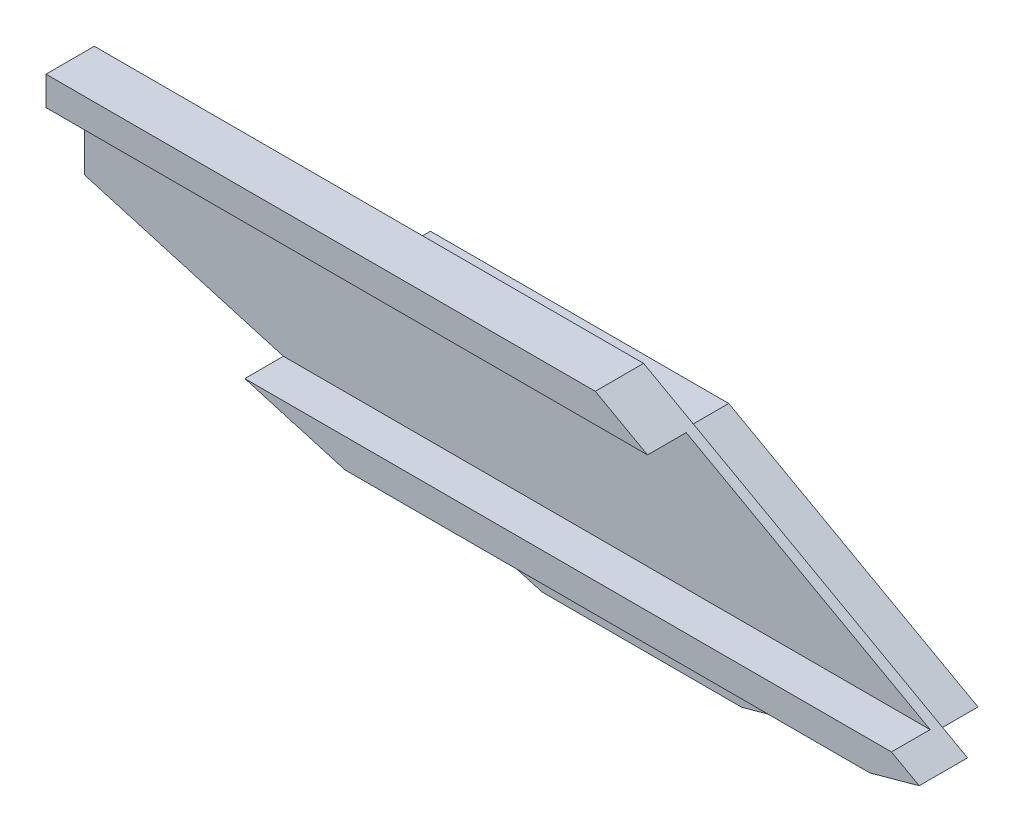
from build123d import *

# Parameters (mm, degrees)
SKETCH_1_W          = 33
SKETCH_1_H          = 10
EXTRUDE_1_DEPTH     = 0.5
SKETCH_2_W          = 34
SKETCH_2_H          = 11
SKETCH_2_W_2        = 33
SKETCH_2_H_2        = 10
EXTRUDE_2_DEPTH     = 1
SKETCH_3_W          = 34
SKETCH_3_H          = 11
EXTRUDE_3_DEPTH     = 0.5
EXTRUDE_4_DEPTH     = 1.275402
EXTRUDE_5_DEPTH     = 0.705896
EXTRUDE_6_DEPTH     = 0.5
EXTRUDE_7_DEPTH     = 1
CUT_EXTRUDE_2_DEPTH = 47.040166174
CUT_EXTRUDE_3_DEPTH = 1
CUT_EXTRUDE_4_DEPTH = 46.951093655
CUT_EXTRUDE_5_DEPTH = 1
CUT_EXTRUDE_7_DEPTH = 1
EXTRUDE_8_DEPTH     = 2
EXTRUDE_9_DEPTH     = 0.5
CUT_EXTRUDE_START   = -1.981298
CUT_EXTRUDE_8_DEPTH = 1.981298
CUT_EXTRUDE_9_DEPTH = 46.975366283


with BuildPart() as part:
    # Sketch 1 → Extrude 1 (new body)
    with BuildSketch(Plane.XY):
        with Locations((16.5, -5)):
            Rectangle(SKETCH_1_W, SKETCH_1_H)
    extrude(amount=EXTRUDE_1_DEPTH)



with BuildPart() as body_2:
    # Sketch 2 → Extrude 2 (new body)
    with BuildSketch(Plane.XY.offset(0.5)):
        with Locations((16.5, -5)):
            Rectangle(SKETCH_2_W, SKETCH_2_H)
        with Locations((16.5, -5)):
            Rectangle(SKETCH_2_W_2, SKETCH_2_H_2, mode=Mode.SUBTRACT)
    extrude(amount=EXTRUDE_2_DEPTH)


with BuildPart() as part_1:
    add(part.part)

    add(body_2.part)  # Extrude 3 merges body 2
    # Sketch 3 → Extrude 3 (add)
    with BuildSketch(Plane(origin=(0, 0, 0.5), x_dir=(-1, 0, 0), z_dir=(0, 0, -1))):
        with Locations((-16.5, -5)):
            Rectangle(SKETCH_3_W, SKETCH_3_H)
    extrude(amount=EXTRUDE_3_DEPTH)

    # Sketch 5 → Extrude 4 (add)
    with BuildSketch(Plane(origin=(0, 0, 0), x_dir=(-1, 0, 0), z_dir=(0, 0, -1))):
        Polygon((-13.305233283, 0.5), (-30.403614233, 0.5), (-33.5, -1.217019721), (-33.5, -4.597847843), align=None)
        Polygon((-33.5, -4.597847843), (-33.5, -1.217019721), (-44.691469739, -7.42295648), align=None)
        Polygon((-29.32623542, -8.976310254), (-33.5, -10.185064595), (-33.5, -10.368560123), (-29.016331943, -10.368560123), (-24.208967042, -8.976310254), align=None)
        Polygon((-19.411033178, -7.586791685), (-24.528301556, -7.586791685), (-19.720936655, -6.194541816), (-14.603668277, -6.194541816), align=None)
        Polygon((-14.923002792, -4.805023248), (-10.115637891, -3.412773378), (-4.998369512, -3.412773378), (-9.805734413, -4.805023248), align=None)
    extrude(amount=EXTRUDE_4_DEPTH)

    # Sketch 6 → Extrude 5 (add)
    with BuildSketch(Plane(origin=(0, 0, -1.275401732), x_dir=(-1, 0, 0), z_dir=(0, 0, -1))):
        Polygon((-44.691469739, -7.42295648), (-13.305233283, 0.5), (-30.403614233, 0.5), align=None)
    extrude(amount=EXTRUDE_5_DEPTH)

    # Sketch 7 → Extrude 6 (add)
    with BuildSketch(Plane.XY):
        Polygon((33.5, -1.217019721), (44.691469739, -7.42295648), (33.5, -10.5), align=None)
    extrude(amount=EXTRUDE_6_DEPTH)

    # Sketch 8 → Extrude 7 (add)
    with BuildSketch(Plane.XY.offset(0.5)):
        Polygon((34, -9.843972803), (43.377034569, -7.265799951), (34, -2.066010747), (33.5, -1.77877644), (30.403614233, 0), (30.403614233, 0.5), (33.5, -1.217019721), (44.691469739, -7.42295648), (33.5, -10.5), (33, -10.5), (33, -10), (33.5, -10), align=None)
    extrude(amount=EXTRUDE_7_DEPTH)

    # Sketch 9 → Cut-Extrude 2 (cut, through all)
    with BuildSketch(Plane.XY.offset(1.5)):
        Polygon((33, 0), (33, -0.939757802), (33.5, -1.217019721), (33.5, 0.5), (30.403614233, 0.5), (31.305288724, 0), align=None)
        Polygon((31.316682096, -0.006317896), (33, -0.939757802), (33, 0), (31.305288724, 0), align=None)
    extrude(amount=-CUT_EXTRUDE_2_DEPTH, mode=Mode.SUBTRACT)

    # Sketch 10 → Cut-Extrude 3 (cut)
    with BuildSketch(Plane.XY.offset(1.5)):
        Polygon((33, -10), (33, -1.491542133), (33.5, -1.77877644), (33.5, -10), align=None)
    extrude(amount=-CUT_EXTRUDE_3_DEPTH, mode=Mode.SUBTRACT)

    # Sketch 11 → Cut-Extrude 4 (cut, through all)
    with BuildSketch(Plane(origin=(0, 0, 0), x_dir=(-1, 0, 0), z_dir=(0, 0, -1))):
        Polygon((-23.164622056, -10.5), (0.5, -3.646543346), (0.5, -10.5), align=None)
    extrude(amount=-CUT_EXTRUDE_4_DEPTH, mode=Mode.SUBTRACT)

    # Sketch 12 → Cut-Extrude 5 (cut)
    with BuildSketch(Plane.XY.offset(0.5)):
        Polygon((33.5, -10), (33.627810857, -10.464858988), (43.509588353, -7.747909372), (43.377034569, -7.265799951), (43.236766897, -7.265799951), (33.566034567, -9.737385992), align=None)
    extrude(amount=CUT_EXTRUDE_5_DEPTH, mode=Mode.SUBTRACT)

    # Sketch 13 → Cut-Extrude 7 (cut)
    with BuildSketch(Plane.XY.offset(1.5)):
        Polygon((33.5, -10.5), (33.627810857, -10.464858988), (33.5, -10), (21.438148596, -10), (23.164622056, -10.5), align=None)
        Polygon((34, -2.066010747), (43.377034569, -7.265799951), (43.509588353, -7.747909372), (44.691469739, -7.42295648), (30.403614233, 0.5), (-0.5, 0.5), (-0.5, -3.646543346), (0, -3.791347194), (0, 0), (30.403614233, 0), align=None)
    extrude(amount=-CUT_EXTRUDE_7_DEPTH, mode=Mode.SUBTRACT)

    # Sketch 15 → Extrude 8 (add)
    with BuildSketch(Plane.XY.offset(0.5)):
        Polygon((-0.5, -0.626032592), (32.434243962, -0.626032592), (27.925873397, 1.873967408), (-0.5, 1.873967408), align=None)
        Polygon((6.335071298, -5.626032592), (39.069483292, -5.626032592), (41.450988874, -5.626032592), (44.691469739, -7.42295648), (42.13432195, -8.126032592), (14.967438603, -8.126032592), align=None)
    extrude(amount=EXTRUDE_8_DEPTH)

    # Sketch 16 → Extrude 9 (add)
    with BuildSketch(Plane(origin=(0, 0, 0.5), x_dir=(-1, 0, 0), z_dir=(0, 0, -1))):
        Polygon((-27.925873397, 1.873967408), (-30.403614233, 0.5), (0.5, 0.5), (0.5, 1.873967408), align=None)
    extrude(amount=EXTRUDE_9_DEPTH)

    # Sketch 17 → Cut-Extrude 8 (cut)
    # profile 1 of 4: a face of its own
    with BuildSketch(Plane(origin=(0, 0, -1.981297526), x_dir=(-1, 0, 0), z_dir=(0, 0, -1)).offset(CUT_EXTRUDE_START)):
        Polygon((-14.923002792, -4.805023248), (-9.805734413, -4.805023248), (-4.998369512, -3.412773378), (-10.115637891, -3.412773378), align=None)
        Polygon((-13.513446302, -4.605023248), (-9.834112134, -4.605023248), (-6.407926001, -3.612773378), (-10.08726017, -3.612773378), align=None, mode=Mode.SUBTRACT)
    # profile 2 of 4: a face of its own
    with BuildSketch(Plane(origin=(0, 0, -1.981297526), x_dir=(-1, 0, 0), z_dir=(0, 0, -1)).offset(CUT_EXTRUDE_START)):
        Polygon((-24.528301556, -7.586791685), (-19.411033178, -7.586791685), (-14.603668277, -6.194541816), (-19.720936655, -6.194541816), align=None)
        Polygon((-23.118745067, -7.386791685), (-19.439410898, -7.386791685), (-16.013224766, -6.394541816), (-19.692558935, -6.394541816), align=None, mode=Mode.SUBTRACT)
    # profile 3 of 4: a face of its own
    with BuildSketch(Plane(origin=(0, 0, -1.981297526), x_dir=(-1, 0, 0), z_dir=(0, 0, -1)).offset(CUT_EXTRUDE_START)):
        Polygon((-33.5, -10.368560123), (-29.016331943, -10.368560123), (-24.208967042, -8.976310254), (-29.32623542, -8.976310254), (-33.5, -10.185064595), align=None)
        Polygon((-32.724043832, -10.168560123), (-29.044709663, -10.168560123), (-25.618523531, -9.176310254), (-29.297857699, -9.176310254), align=None, mode=Mode.SUBTRACT)
    # profile 4 of 4: a face of its own
    with BuildSketch(Plane(origin=(0, 0, -1.981297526), x_dir=(-1, 0, 0), z_dir=(0, 0, -1)).offset(CUT_EXTRUDE_START)):
        Polygon((-30.403614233, 0.5), (-44.691469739, -7.42295648), (-13.305233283, 0.5), align=None)
        Polygon((-30.351873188, 0.3), (-43.251614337, -6.853213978), (-14.914658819, 0.3), align=None, mode=Mode.SUBTRACT)
    extrude(amount=CUT_EXTRUDE_8_DEPTH, mode=Mode.SUBTRACT)

    # Sketch 18 → Cut-Extrude 9 (cut, through all)
    with BuildSketch(Plane.XY.offset(0.5)):
        Polygon((-0.5, 0.373967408), (24.737346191, 0.373967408), (30.630895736, 0.373967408), (32.434243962, -0.626032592), (-0.5, -0.626032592), align=None)
        Polygon((9.78801822, -6.626032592), (43.254337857, -6.626032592), (41.450988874, -5.626032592), (6.335071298, -5.626032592), align=None)
    extrude(amount=CUT_EXTRUDE_9_DEPTH, mode=Mode.SUBTRACT)


solid = part_1.part
